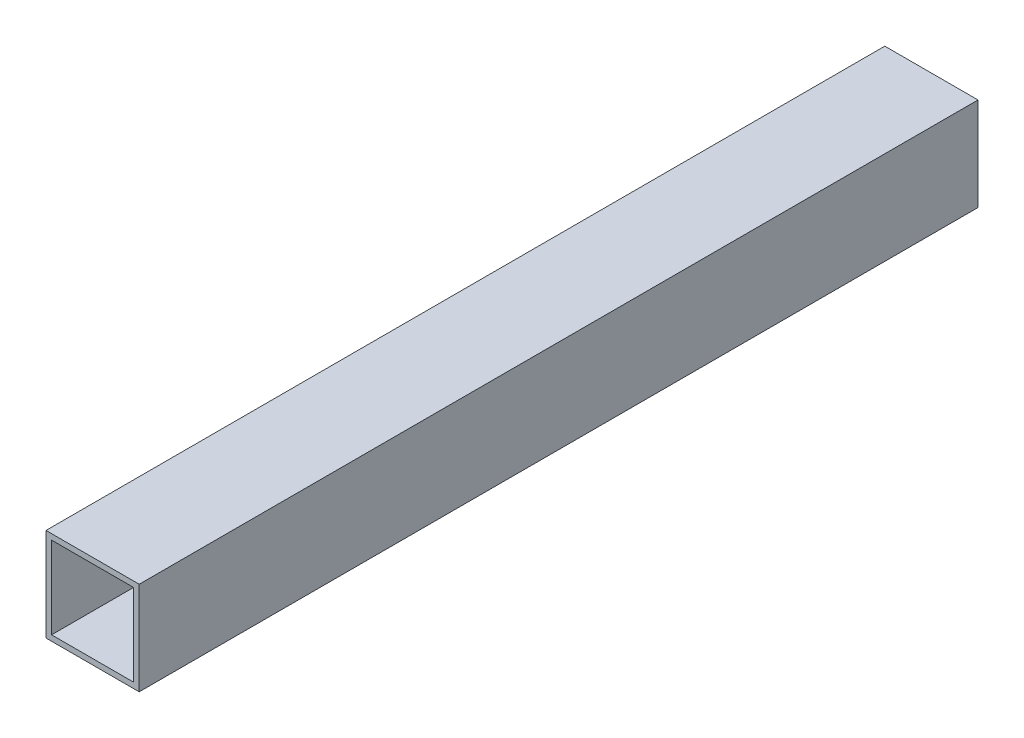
from build123d import *

# Parameters (mm, degrees)
SKETCH1_W           = 100
SKETCH1_H           = 100
SKETCH1_W_2         = 88
SKETCH1_H_2         = 88
BOSS_EXTRUDE1_DEPTH = 450


with BuildPart() as part:
    # Sketch1 → Boss-Extrude1 (new, symmetric)
    with BuildSketch(Plane.XY):
        Rectangle(SKETCH1_W, SKETCH1_H)
        Rectangle(SKETCH1_W_2, SKETCH1_H_2, mode=Mode.SUBTRACT)
    extrude(amount=BOSS_EXTRUDE1_DEPTH, both=True)


solid = part.part
